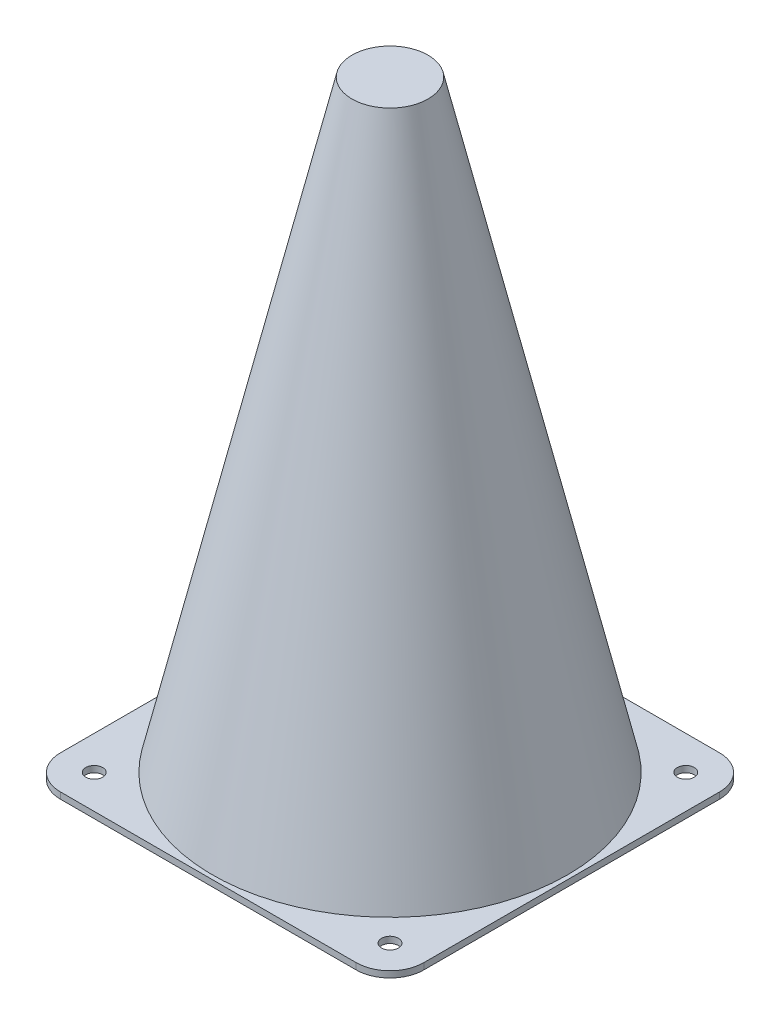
ISO-10303-21;
HEADER;
FILE_DESCRIPTION(('STEP AP214'),'2;1');
FILE_NAME('part.step','',(''),(''),'','','');
FILE_SCHEMA(('AUTOMOTIVE_DESIGN { 1 0 10303 214 1 1 1 1 }'));
ENDSEC;
DATA;
#1=APPLICATION_CONTEXT('core data for automotive mechanical design processes');
#2=APPLICATION_PROTOCOL_DEFINITION('international standard','automotive_design',2000,#1);
#3=PRODUCT_CONTEXT('',#1,'mechanical');
#4=PRODUCT('Part','Part','',(#3));
#5=PRODUCT_RELATED_PRODUCT_CATEGORY('part','',(#4));
#6=PRODUCT_DEFINITION_FORMATION('','',#4);
#7=PRODUCT_DEFINITION_CONTEXT('part definition',#1,'design');
#8=PRODUCT_DEFINITION('design','',#6,#7);
#9=PRODUCT_DEFINITION_SHAPE('','',#8);
#10=(LENGTH_UNIT() NAMED_UNIT(*) SI_UNIT(.MILLI.,.METRE.));
#11=(NAMED_UNIT(*) PLANE_ANGLE_UNIT() SI_UNIT($,.RADIAN.));
#12=(NAMED_UNIT(*) SI_UNIT($,.STERADIAN.) SOLID_ANGLE_UNIT());
#13=UNCERTAINTY_MEASURE_WITH_UNIT(LENGTH_MEASURE(1.E-05),#10,'distance_accuracy_value','');
#14=(GEOMETRIC_REPRESENTATION_CONTEXT(3) GLOBAL_UNCERTAINTY_ASSIGNED_CONTEXT((#13)) GLOBAL_UNIT_ASSIGNED_CONTEXT((#10,
#11,#12)) REPRESENTATION_CONTEXT('',''));
#15=CARTESIAN_POINT('',(0.,0.,0.));
#16=DIRECTION('',(0.,0.,1.));
#17=DIRECTION('',(1.,0.,0.));
#18=AXIS2_PLACEMENT_3D('',#15,#16,#17);
#19=CARTESIAN_POINT('',(55.5625,2.38125,-55.5625));
#20=DIRECTION('',(0.,1.,0.));
#21=DIRECTION('',(0.,0.,1.));
#22=AXIS2_PLACEMENT_3D('',#19,#20,#21);
#23=PLANE('',#22);
#24=CARTESIAN_POINT('',(55.5625,2.38125,55.5625));
#25=DIRECTION('',(0.,1.,0.));
#26=DIRECTION('',(0.,0.,1.));
#27=AXIS2_PLACEMENT_3D('',#24,#25,#26);
#28=CIRCLE('',#27,3.175);
#29=CARTESIAN_POINT('',(55.5625,2.38125,52.3875));
#30=VERTEX_POINT('',#29);
#31=EDGE_CURVE('E195',#30,#30,#28,.T.);
#32=ORIENTED_EDGE('',*,*,#31,.F.);
#33=EDGE_LOOP('',(#32));
#34=FACE_BOUND('',#33,.T.);
#35=CARTESIAN_POINT('',(-55.5625,2.38125,-55.5625));
#36=DIRECTION('',(0.,1.,0.));
#37=DIRECTION('',(0.,0.,1.));
#38=AXIS2_PLACEMENT_3D('',#35,#36,#37);
#39=CIRCLE('',#38,3.175);
#40=CARTESIAN_POINT('',(-55.5625,2.38125,-58.7375));
#41=VERTEX_POINT('',#40);
#42=EDGE_CURVE('E183',#41,#41,#39,.T.);
#43=ORIENTED_EDGE('',*,*,#42,.F.);
#44=EDGE_LOOP('',(#43));
#45=FACE_BOUND('',#44,.T.);
#46=CARTESIAN_POINT('',(55.5625,2.38125,-55.5625));
#47=DIRECTION('',(0.,1.,0.));
#48=DIRECTION('',(0.,0.,1.));
#49=AXIS2_PLACEMENT_3D('',#46,#47,#48);
#50=CIRCLE('',#49,12.7);
#51=CARTESIAN_POINT('',(68.2624999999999,2.38125,-55.5625));
#52=VERTEX_POINT('',#51);
#53=CARTESIAN_POINT('',(55.5625,2.38125,-68.2625));
#54=VERTEX_POINT('',#53);
#55=EDGE_CURVE('E143',#52,#54,#50,.T.);
#56=ORIENTED_EDGE('',*,*,#55,.T.);
#57=DIRECTION('',(-1.,0.,0.));
#58=VECTOR('',#57,1.);
#59=CARTESIAN_POINT('',(-55.5625,2.38125,-68.2625));
#60=LINE('',#59,#58);
#61=CARTESIAN_POINT('',(-55.5625,2.38125,-68.2625));
#62=VERTEX_POINT('',#61);
#63=EDGE_CURVE('E91',#54,#62,#60,.T.);
#64=ORIENTED_EDGE('',*,*,#63,.T.);
#65=CARTESIAN_POINT('',(-55.5625,2.38125,-55.5625));
#66=DIRECTION('',(0.,1.,0.));
#67=DIRECTION('',(0.,0.,1.));
#68=AXIS2_PLACEMENT_3D('',#65,#66,#67);
#69=CIRCLE('',#68,12.7);
#70=CARTESIAN_POINT('',(-68.2625,2.38125,-55.5625));
#71=VERTEX_POINT('',#70);
#72=EDGE_CURVE('E158',#62,#71,#69,.T.);
#73=ORIENTED_EDGE('',*,*,#72,.T.);
#74=DIRECTION('',(0.,0.,1.));
#75=VECTOR('',#74,1.);
#76=CARTESIAN_POINT('',(-68.2625,2.38125,-55.5625));
#77=LINE('',#76,#75);
#78=CARTESIAN_POINT('',(-68.2625,2.38125,55.5625));
#79=VERTEX_POINT('',#78);
#80=EDGE_CURVE('E171',#71,#79,#77,.T.);
#81=ORIENTED_EDGE('',*,*,#80,.T.);
#82=CARTESIAN_POINT('',(-55.5625,2.38125,55.5625));
#83=DIRECTION('',(0.,1.,0.));
#84=DIRECTION('',(0.,0.,-1.));
#85=AXIS2_PLACEMENT_3D('',#82,#83,#84);
#86=CIRCLE('',#85,12.7);
#87=CARTESIAN_POINT('',(-55.5625,2.38125,68.2625));
#88=VERTEX_POINT('',#87);
#89=EDGE_CURVE('E110',#79,#88,#86,.T.);
#90=ORIENTED_EDGE('',*,*,#89,.T.);
#91=DIRECTION('',(1.,0.,0.));
#92=VECTOR('',#91,1.);
#93=CARTESIAN_POINT('',(-55.5625,2.38125,68.2625));
#94=LINE('',#93,#92);
#95=CARTESIAN_POINT('',(55.5625,2.38125,68.2625));
#96=VERTEX_POINT('',#95);
#97=EDGE_CURVE('E104',#88,#96,#94,.T.);
#98=ORIENTED_EDGE('',*,*,#97,.T.);
#99=CARTESIAN_POINT('',(55.5625,2.38125,55.5625));
#100=DIRECTION('',(0.,1.,0.));
#101=DIRECTION('',(0.,0.,-1.));
#102=AXIS2_PLACEMENT_3D('',#99,#100,#101);
#103=CIRCLE('',#102,12.7);
#104=CARTESIAN_POINT('',(68.2624999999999,2.38125,55.5625));
#105=VERTEX_POINT('',#104);
#106=EDGE_CURVE('E108',#96,#105,#103,.T.);
#107=ORIENTED_EDGE('',*,*,#106,.T.);
#108=DIRECTION('',(0.,0.,-1.));
#109=VECTOR('',#108,1.);
#110=CARTESIAN_POINT('',(68.2624999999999,2.38125,-55.5625));
#111=LINE('',#110,#109);
#112=EDGE_CURVE('E48',#105,#52,#111,.T.);
#113=ORIENTED_EDGE('',*,*,#112,.T.);
#114=EDGE_LOOP('',(#56,#64,#73,#81,#90,#98,#107,#113));
#115=FACE_BOUND('',#114,.T.);
#116=CARTESIAN_POINT('',(55.5625,2.38125,-55.5625));
#117=DIRECTION('',(0.,1.,0.));
#118=DIRECTION('',(0.,0.,1.));
#119=AXIS2_PLACEMENT_3D('',#116,#117,#118);
#120=CIRCLE('',#119,3.175);
#121=CARTESIAN_POINT('',(55.5625,2.38125,-58.7375));
#122=VERTEX_POINT('',#121);
#123=EDGE_CURVE('E179',#122,#122,#120,.T.);
#124=ORIENTED_EDGE('',*,*,#123,.F.);
#125=EDGE_LOOP('',(#124));
#126=FACE_BOUND('',#125,.T.);
#127=CARTESIAN_POINT('',(-55.5625,2.38125,55.5625));
#128=DIRECTION('',(0.,1.,0.));
#129=DIRECTION('',(0.,0.,1.));
#130=AXIS2_PLACEMENT_3D('',#127,#128,#129);
#131=CIRCLE('',#130,3.175);
#132=CARTESIAN_POINT('',(-55.5625,2.38125,52.3875));
#133=VERTEX_POINT('',#132);
#134=EDGE_CURVE('E189',#133,#133,#131,.T.);
#135=ORIENTED_EDGE('',*,*,#134,.F.);
#136=EDGE_LOOP('',(#135));
#137=FACE_BOUND('',#136,.T.);
#138=CARTESIAN_POINT('',(0.,2.38125,0.));
#139=DIRECTION('',(0.,1.,0.));
#140=DIRECTION('',(-1.,0.,0.));
#141=AXIS2_PLACEMENT_3D('',#138,#139,#140);
#142=CIRCLE('',#141,66.7170786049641);
#143=CARTESIAN_POINT('',(66.7170786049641,2.38125,0.));
#144=VERTEX_POINT('',#143);
#145=EDGE_CURVE('E212',#144,#144,#142,.T.);
#146=ORIENTED_EDGE('',*,*,#145,.F.);
#147=EDGE_LOOP('',(#146));
#148=FACE_BOUND('',#147,.T.);
#149=ADVANCED_FACE('F31',(#34,#45,#115,#126,#137,#148),#23,.T.);
#150=CARTESIAN_POINT('',(55.5625,0.,-55.5625));
#151=DIRECTION('',(0.,1.,0.));
#152=DIRECTION('',(0.,0.,1.));
#153=AXIS2_PLACEMENT_3D('',#150,#151,#152);
#154=PLANE('',#153);
#155=CARTESIAN_POINT('',(-55.5625,0.,55.5625));
#156=DIRECTION('',(0.,1.,0.));
#157=DIRECTION('',(0.,0.,1.));
#158=AXIS2_PLACEMENT_3D('',#155,#156,#157);
#159=CIRCLE('',#158,3.175);
#160=CARTESIAN_POINT('',(-55.5625,0.,52.3875));
#161=VERTEX_POINT('',#160);
#162=EDGE_CURVE('E192',#161,#161,#159,.T.);
#163=ORIENTED_EDGE('',*,*,#162,.T.);
#164=EDGE_LOOP('',(#163));
#165=FACE_BOUND('',#164,.T.);
#166=CARTESIAN_POINT('',(55.5625,0.,-55.5625));
#167=DIRECTION('',(0.,1.,0.));
#168=DIRECTION('',(0.,0.,1.));
#169=AXIS2_PLACEMENT_3D('',#166,#167,#168);
#170=CIRCLE('',#169,3.175);
#171=CARTESIAN_POINT('',(55.5625,0.,-58.7375));
#172=VERTEX_POINT('',#171);
#173=EDGE_CURVE('E180',#172,#172,#170,.T.);
#174=ORIENTED_EDGE('',*,*,#173,.T.);
#175=EDGE_LOOP('',(#174));
#176=FACE_BOUND('',#175,.T.);
#177=CARTESIAN_POINT('',(55.5625,0.,-55.5625));
#178=DIRECTION('',(0.,1.,0.));
#179=DIRECTION('',(0.,0.,1.));
#180=AXIS2_PLACEMENT_3D('',#177,#178,#179);
#181=CIRCLE('',#180,12.7);
#182=CARTESIAN_POINT('',(68.2624999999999,0.,-55.5625));
#183=VERTEX_POINT('',#182);
#184=CARTESIAN_POINT('',(55.5625,0.,-68.2625));
#185=VERTEX_POINT('',#184);
#186=EDGE_CURVE('E128',#183,#185,#181,.T.);
#187=ORIENTED_EDGE('',*,*,#186,.F.);
#188=DIRECTION('',(0.,0.,-1.));
#189=VECTOR('',#188,1.);
#190=CARTESIAN_POINT('',(68.2624999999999,0.,-55.5625));
#191=LINE('',#190,#189);
#192=CARTESIAN_POINT('',(68.2624999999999,0.,55.5625));
#193=VERTEX_POINT('',#192);
#194=EDGE_CURVE('E83',#193,#183,#191,.T.);
#195=ORIENTED_EDGE('',*,*,#194,.F.);
#196=CARTESIAN_POINT('',(55.5625,0.,55.5625));
#197=DIRECTION('',(0.,1.,0.));
#198=DIRECTION('',(0.,0.,-1.));
#199=AXIS2_PLACEMENT_3D('',#196,#197,#198);
#200=CIRCLE('',#199,12.7);
#201=CARTESIAN_POINT('',(55.5625,0.,68.2625));
#202=VERTEX_POINT('',#201);
#203=EDGE_CURVE('E77',#202,#193,#200,.T.);
#204=ORIENTED_EDGE('',*,*,#203,.F.);
#205=DIRECTION('',(1.,0.,0.));
#206=VECTOR('',#205,1.);
#207=CARTESIAN_POINT('',(-55.5625,0.,68.2625));
#208=LINE('',#207,#206);
#209=CARTESIAN_POINT('',(-55.5625,0.,68.2625));
#210=VERTEX_POINT('',#209);
#211=EDGE_CURVE('E118',#210,#202,#208,.T.);
#212=ORIENTED_EDGE('',*,*,#211,.F.);
#213=CARTESIAN_POINT('',(-55.5625,0.,55.5625));
#214=DIRECTION('',(0.,1.,0.));
#215=DIRECTION('',(0.,0.,-1.));
#216=AXIS2_PLACEMENT_3D('',#213,#214,#215);
#217=CIRCLE('',#216,12.7);
#218=CARTESIAN_POINT('',(-68.2625,0.,55.5625));
#219=VERTEX_POINT('',#218);
#220=EDGE_CURVE('E138',#219,#210,#217,.T.);
#221=ORIENTED_EDGE('',*,*,#220,.F.);
#222=DIRECTION('',(0.,0.,1.));
#223=VECTOR('',#222,1.);
#224=CARTESIAN_POINT('',(-68.2625,0.,-55.5625));
#225=LINE('',#224,#223);
#226=CARTESIAN_POINT('',(-68.2625,0.,-55.5625));
#227=VERTEX_POINT('',#226);
#228=EDGE_CURVE('E136',#227,#219,#225,.T.);
#229=ORIENTED_EDGE('',*,*,#228,.F.);
#230=CARTESIAN_POINT('',(-55.5625,0.,-55.5625));
#231=DIRECTION('',(0.,1.,0.));
#232=DIRECTION('',(0.,0.,1.));
#233=AXIS2_PLACEMENT_3D('',#230,#231,#232);
#234=CIRCLE('',#233,12.7);
#235=CARTESIAN_POINT('',(-55.5625,0.,-68.2625));
#236=VERTEX_POINT('',#235);
#237=EDGE_CURVE('E134',#236,#227,#234,.T.);
#238=ORIENTED_EDGE('',*,*,#237,.F.);
#239=DIRECTION('',(-1.,0.,0.));
#240=VECTOR('',#239,1.);
#241=CARTESIAN_POINT('',(-55.5625,0.,-68.2625));
#242=LINE('',#241,#240);
#243=EDGE_CURVE('E131',#185,#236,#242,.T.);
#244=ORIENTED_EDGE('',*,*,#243,.F.);
#245=EDGE_LOOP('',(#187,#195,#204,#212,#221,#229,#238,#244));
#246=FACE_BOUND('',#245,.T.);
#247=CARTESIAN_POINT('',(0.,0.,0.));
#248=DIRECTION('',(0.,1.,0.));
#249=DIRECTION('',(0.,0.,1.));
#250=AXIS2_PLACEMENT_3D('',#247,#248,#249);
#251=CIRCLE('',#250,65.0875);
#252=CARTESIAN_POINT('',(0.,0.,-65.0875));
#253=VERTEX_POINT('',#252);
#254=EDGE_CURVE('E132',#253,#253,#251,.T.);
#255=ORIENTED_EDGE('',*,*,#254,.T.);
#256=EDGE_LOOP('',(#255));
#257=FACE_BOUND('',#256,.T.);
#258=CARTESIAN_POINT('',(-55.5625,0.,-55.5625));
#259=DIRECTION('',(0.,1.,0.));
#260=DIRECTION('',(0.,0.,1.));
#261=AXIS2_PLACEMENT_3D('',#258,#259,#260);
#262=CIRCLE('',#261,3.175);
#263=CARTESIAN_POINT('',(-55.5625,0.,-58.7375));
#264=VERTEX_POINT('',#263);
#265=EDGE_CURVE('E186',#264,#264,#262,.T.);
#266=ORIENTED_EDGE('',*,*,#265,.T.);
#267=EDGE_LOOP('',(#266));
#268=FACE_BOUND('',#267,.T.);
#269=CARTESIAN_POINT('',(55.5625,0.,55.5625));
#270=DIRECTION('',(0.,1.,0.));
#271=DIRECTION('',(0.,0.,1.));
#272=AXIS2_PLACEMENT_3D('',#269,#270,#271);
#273=CIRCLE('',#272,3.175);
#274=CARTESIAN_POINT('',(55.5625,0.,52.3875));
#275=VERTEX_POINT('',#274);
#276=EDGE_CURVE('E198',#275,#275,#273,.T.);
#277=ORIENTED_EDGE('',*,*,#276,.T.);
#278=EDGE_LOOP('',(#277));
#279=FACE_BOUND('',#278,.T.);
#280=ADVANCED_FACE('F162',(#165,#176,#246,#257,#268,#279),#154,.F.);
#281=CARTESIAN_POINT('',(55.5625,2.38125,-55.5625));
#282=DIRECTION('',(0.,-1.,0.));
#283=DIRECTION('',(0.,0.,-1.));
#284=AXIS2_PLACEMENT_3D('',#281,#282,#283);
#285=CYLINDRICAL_SURFACE('',#284,12.7);
#286=ORIENTED_EDGE('',*,*,#186,.T.);
#287=DIRECTION('',(0.,-1.,0.));
#288=VECTOR('',#287,1.);
#289=CARTESIAN_POINT('',(55.5625,2.38125,-68.2625));
#290=LINE('',#289,#288);
#291=EDGE_CURVE('E11',#54,#185,#290,.T.);
#292=ORIENTED_EDGE('',*,*,#291,.F.);
#293=ORIENTED_EDGE('',*,*,#55,.F.);
#294=DIRECTION('',(0.,-1.,0.));
#295=VECTOR('',#294,1.);
#296=CARTESIAN_POINT('',(68.2624999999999,2.38125,-55.5625));
#297=LINE('',#296,#295);
#298=EDGE_CURVE('E124',#52,#183,#297,.T.);
#299=ORIENTED_EDGE('',*,*,#298,.T.);
#300=EDGE_LOOP('',(#286,#292,#293,#299));
#301=FACE_BOUND('',#300,.T.);
#302=ADVANCED_FACE('F33',(#301),#285,.T.);
#303=CARTESIAN_POINT('',(-55.5625,2.38125,-68.2625));
#304=DIRECTION('',(0.,0.,1.));
#305=DIRECTION('',(1.,0.,0.));
#306=AXIS2_PLACEMENT_3D('',#303,#304,#305);
#307=PLANE('',#306);
#308=ORIENTED_EDGE('',*,*,#243,.T.);
#309=DIRECTION('',(0.,-1.,0.));
#310=VECTOR('',#309,1.);
#311=CARTESIAN_POINT('',(-55.5625,2.38125,-68.2625));
#312=LINE('',#311,#310);
#313=EDGE_CURVE('E40',#62,#236,#312,.T.);
#314=ORIENTED_EDGE('',*,*,#313,.F.);
#315=ORIENTED_EDGE('',*,*,#63,.F.);
#316=ORIENTED_EDGE('',*,*,#291,.T.);
#317=EDGE_LOOP('',(#308,#314,#315,#316));
#318=FACE_BOUND('',#317,.T.);
#319=ADVANCED_FACE('F244',(#318),#307,.F.);
#320=CARTESIAN_POINT('',(-55.5625,2.38125,-55.5625));
#321=DIRECTION('',(0.,-1.,0.));
#322=DIRECTION('',(0.,0.,-1.));
#323=AXIS2_PLACEMENT_3D('',#320,#321,#322);
#324=CYLINDRICAL_SURFACE('',#323,12.7);
#325=ORIENTED_EDGE('',*,*,#237,.T.);
#326=DIRECTION('',(0.,-1.,0.));
#327=VECTOR('',#326,1.);
#328=CARTESIAN_POINT('',(-68.2625,2.38125,-55.5625));
#329=LINE('',#328,#327);
#330=EDGE_CURVE('E150',#71,#227,#329,.T.);
#331=ORIENTED_EDGE('',*,*,#330,.F.);
#332=ORIENTED_EDGE('',*,*,#72,.F.);
#333=ORIENTED_EDGE('',*,*,#313,.T.);
#334=EDGE_LOOP('',(#325,#331,#332,#333));
#335=FACE_BOUND('',#334,.T.);
#336=ADVANCED_FACE('F156',(#335),#324,.T.);
#337=CARTESIAN_POINT('',(-68.2625,2.38125,-55.5625));
#338=DIRECTION('',(1.,0.,0.));
#339=DIRECTION('',(0.,0.,-1.));
#340=AXIS2_PLACEMENT_3D('',#337,#338,#339);
#341=PLANE('',#340);
#342=ORIENTED_EDGE('',*,*,#228,.T.);
#343=DIRECTION('',(0.,-1.,0.));
#344=VECTOR('',#343,1.);
#345=CARTESIAN_POINT('',(-68.2625,2.38125,55.5625));
#346=LINE('',#345,#344);
#347=EDGE_CURVE('E147',#79,#219,#346,.T.);
#348=ORIENTED_EDGE('',*,*,#347,.F.);
#349=ORIENTED_EDGE('',*,*,#80,.F.);
#350=ORIENTED_EDGE('',*,*,#330,.T.);
#351=EDGE_LOOP('',(#342,#348,#349,#350));
#352=FACE_BOUND('',#351,.T.);
#353=ADVANCED_FACE('F167',(#352),#341,.F.);
#354=CARTESIAN_POINT('',(-55.5625,2.38125,55.5625));
#355=DIRECTION('',(0.,-1.,0.));
#356=DIRECTION('',(0.,0.,-1.));
#357=AXIS2_PLACEMENT_3D('',#354,#355,#356);
#358=CYLINDRICAL_SURFACE('',#357,12.7);
#359=ORIENTED_EDGE('',*,*,#220,.T.);
#360=DIRECTION('',(0.,-1.,0.));
#361=VECTOR('',#360,1.);
#362=CARTESIAN_POINT('',(-55.5625,2.38125,68.2625));
#363=LINE('',#362,#361);
#364=EDGE_CURVE('E119',#88,#210,#363,.T.);
#365=ORIENTED_EDGE('',*,*,#364,.F.);
#366=ORIENTED_EDGE('',*,*,#89,.F.);
#367=ORIENTED_EDGE('',*,*,#347,.T.);
#368=EDGE_LOOP('',(#359,#365,#366,#367));
#369=FACE_BOUND('',#368,.T.);
#370=ADVANCED_FACE('F170',(#369),#358,.T.);
#371=CARTESIAN_POINT('',(-55.5625,2.38125,68.2625));
#372=DIRECTION('',(0.,0.,-1.));
#373=DIRECTION('',(-1.,0.,0.));
#374=AXIS2_PLACEMENT_3D('',#371,#372,#373);
#375=PLANE('',#374);
#376=ORIENTED_EDGE('',*,*,#211,.T.);
#377=DIRECTION('',(0.,-1.,0.));
#378=VECTOR('',#377,1.);
#379=CARTESIAN_POINT('',(55.5625,2.38125,68.2625));
#380=LINE('',#379,#378);
#381=EDGE_CURVE('E115',#96,#202,#380,.T.);
#382=ORIENTED_EDGE('',*,*,#381,.F.);
#383=ORIENTED_EDGE('',*,*,#97,.F.);
#384=ORIENTED_EDGE('',*,*,#364,.T.);
#385=EDGE_LOOP('',(#376,#382,#383,#384));
#386=FACE_BOUND('',#385,.T.);
#387=ADVANCED_FACE('F116',(#386),#375,.F.);
#388=CARTESIAN_POINT('',(55.5625,2.38125,55.5625));
#389=DIRECTION('',(0.,-1.,0.));
#390=DIRECTION('',(0.,0.,-1.));
#391=AXIS2_PLACEMENT_3D('',#388,#389,#390);
#392=CYLINDRICAL_SURFACE('',#391,12.7);
#393=ORIENTED_EDGE('',*,*,#203,.T.);
#394=DIRECTION('',(0.,-1.,0.));
#395=VECTOR('',#394,1.);
#396=CARTESIAN_POINT('',(68.2624999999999,2.38125,55.5625));
#397=LINE('',#396,#395);
#398=EDGE_CURVE('E120',#105,#193,#397,.T.);
#399=ORIENTED_EDGE('',*,*,#398,.F.);
#400=ORIENTED_EDGE('',*,*,#106,.F.);
#401=ORIENTED_EDGE('',*,*,#381,.T.);
#402=EDGE_LOOP('',(#393,#399,#400,#401));
#403=FACE_BOUND('',#402,.T.);
#404=ADVANCED_FACE('F122',(#403),#392,.T.);
#405=CARTESIAN_POINT('',(68.2624999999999,2.38125,-55.5625));
#406=DIRECTION('',(-1.,0.,0.));
#407=DIRECTION('',(0.,0.,1.));
#408=AXIS2_PLACEMENT_3D('',#405,#406,#407);
#409=PLANE('',#408);
#410=ORIENTED_EDGE('',*,*,#194,.T.);
#411=ORIENTED_EDGE('',*,*,#298,.F.);
#412=ORIENTED_EDGE('',*,*,#112,.F.);
#413=ORIENTED_EDGE('',*,*,#398,.T.);
#414=EDGE_LOOP('',(#410,#411,#412,#413));
#415=FACE_BOUND('',#414,.T.);
#416=ADVANCED_FACE('F232',(#415),#409,.F.);
#417=CARTESIAN_POINT('',(0.,2.38125,0.));
#418=DIRECTION('',(0.,-1.,0.));
#419=DIRECTION('',(0.,0.,-1.));
#420=AXIS2_PLACEMENT_3D('',#417,#418,#419);
#421=CYLINDRICAL_SURFACE('',#420,65.0875);
#422=CARTESIAN_POINT('',(0.,2.38125,0.));
#423=DIRECTION('',(0.,1.,0.));
#424=DIRECTION('',(-1.,0.,0.));
#425=AXIS2_PLACEMENT_3D('',#422,#423,#424);
#426=CIRCLE('',#425,65.0874999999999);
#427=CARTESIAN_POINT('',(0.,2.38125,-65.0875));
#428=VERTEX_POINT('',#427);
#429=EDGE_CURVE('E201',#428,#428,#426,.T.);
#430=CARTESIAN_POINT('',(0.,2.38125,-65.0875));
#431=CARTESIAN_POINT('',(0.,2.3564453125,-65.0875));
#432=CARTESIAN_POINT('',(0.,2.331640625,-65.0875));
#433=CARTESIAN_POINT('',(0.,2.28203125,-65.0875));
#434=CARTESIAN_POINT('',(0.,2.2572265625,-65.0875));
#435=CARTESIAN_POINT('',(0.,2.2076171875,-65.0875));
#436=CARTESIAN_POINT('',(0.,2.1828125,-65.0875));
#437=CARTESIAN_POINT('',(0.,2.133203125,-65.0875));
#438=CARTESIAN_POINT('',(0.,2.1083984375,-65.0875));
#439=CARTESIAN_POINT('',(0.,2.0587890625,-65.0875));
#440=CARTESIAN_POINT('',(0.,2.033984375,-65.0875));
#441=CARTESIAN_POINT('',(0.,1.984375,-65.0875));
#442=CARTESIAN_POINT('',(0.,1.9595703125,-65.0875));
#443=CARTESIAN_POINT('',(0.,1.9099609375,-65.0875));
#444=CARTESIAN_POINT('',(0.,1.88515625,-65.0875));
#445=CARTESIAN_POINT('',(0.,1.835546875,-65.0875));
#446=CARTESIAN_POINT('',(0.,1.8107421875,-65.0875));
#447=CARTESIAN_POINT('',(0.,1.7611328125,-65.0875));
#448=CARTESIAN_POINT('',(0.,1.736328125,-65.0875));
#449=CARTESIAN_POINT('',(0.,1.68671875,-65.0875));
#450=CARTESIAN_POINT('',(0.,1.6619140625,-65.0875));
#451=CARTESIAN_POINT('',(0.,1.6123046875,-65.0875));
#452=CARTESIAN_POINT('',(0.,1.5875,-65.0875));
#453=CARTESIAN_POINT('',(0.,1.537890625,-65.0875));
#454=CARTESIAN_POINT('',(0.,1.5130859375,-65.0875));
#455=CARTESIAN_POINT('',(0.,1.4634765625,-65.0875));
#456=CARTESIAN_POINT('',(0.,1.438671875,-65.0875));
#457=CARTESIAN_POINT('',(0.,1.3890625,-65.0875));
#458=CARTESIAN_POINT('',(0.,1.3642578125,-65.0875));
#459=CARTESIAN_POINT('',(0.,1.3146484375,-65.0875));
#460=CARTESIAN_POINT('',(0.,1.28984375,-65.0875));
#461=CARTESIAN_POINT('',(0.,1.240234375,-65.0875));
#462=CARTESIAN_POINT('',(0.,1.2154296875,-65.0875));
#463=CARTESIAN_POINT('',(0.,1.1658203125,-65.0875));
#464=CARTESIAN_POINT('',(0.,1.141015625,-65.0875));
#465=CARTESIAN_POINT('',(0.,1.09140625,-65.0875));
#466=CARTESIAN_POINT('',(0.,1.0666015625,-65.0875));
#467=CARTESIAN_POINT('',(0.,1.0169921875,-65.0875));
#468=CARTESIAN_POINT('',(0.,0.992187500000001,-65.0875));
#469=CARTESIAN_POINT('',(0.,0.942578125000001,-65.0875));
#470=CARTESIAN_POINT('',(0.,0.917773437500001,-65.0875));
#471=CARTESIAN_POINT('',(0.,0.8681640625,-65.0875));
#472=CARTESIAN_POINT('',(0.,0.843359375,-65.0875));
#473=CARTESIAN_POINT('',(0.,0.79375,-65.0875));
#474=CARTESIAN_POINT('',(0.,0.7689453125,-65.0875));
#475=CARTESIAN_POINT('',(0.,0.7193359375,-65.0875));
#476=CARTESIAN_POINT('',(0.,0.69453125,-65.0875));
#477=CARTESIAN_POINT('',(0.,0.644921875,-65.0875));
#478=CARTESIAN_POINT('',(0.,0.6201171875,-65.0875));
#479=CARTESIAN_POINT('',(0.,0.5705078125,-65.0875));
#480=CARTESIAN_POINT('',(0.,0.545703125,-65.0875));
#481=CARTESIAN_POINT('',(0.,0.49609375,-65.0875));
#482=CARTESIAN_POINT('',(0.,0.4712890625,-65.0875));
#483=CARTESIAN_POINT('',(0.,0.4216796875,-65.0875));
#484=CARTESIAN_POINT('',(0.,0.396875,-65.0875));
#485=CARTESIAN_POINT('',(0.,0.347265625,-65.0875));
#486=CARTESIAN_POINT('',(0.,0.3224609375,-65.0875));
#487=CARTESIAN_POINT('',(0.,0.2728515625,-65.0875));
#488=CARTESIAN_POINT('',(0.,0.248046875,-65.0875));
#489=CARTESIAN_POINT('',(0.,0.1984375,-65.0875));
#490=CARTESIAN_POINT('',(0.,0.1736328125,-65.0875));
#491=CARTESIAN_POINT('',(0.,0.1240234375,-65.0875));
#492=CARTESIAN_POINT('',(0.,0.0992187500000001,-65.0875));
#493=CARTESIAN_POINT('',(0.,0.049609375,-65.0875));
#494=CARTESIAN_POINT('',(0.,0.0248046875,-65.0875));
#495=CARTESIAN_POINT('',(0.,0.,-65.0875));
#496=B_SPLINE_CURVE_WITH_KNOTS('',3,(#430,#431,#432,#433,#434,#435,#436,#437,#438,#439,#440,
#441,#442,#443,#444,#445,#446,#447,#448,#449,#450,#451,#452,#453,#454,#455,#456,#457,#458,#459,
#460,#461,#462,#463,#464,#465,#466,#467,#468,#469,#470,#471,#472,#473,#474,#475,#476,#477,#478,
#479,#480,#481,#482,#483,#484,#485,#486,#487,#488,#489,#490,#491,#492,#493,#494,#495),
.UNSPECIFIED.,.F.,.F.,(4,2,2,2,2,2,2,2,2,2,2,2,2,2,2,2,2,2,2,2,2,2,2,2,2,2,2,2,2,2,2,2,4),(0.,
0.0744140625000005,0.148828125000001,0.223242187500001,0.297656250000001,0.372070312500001,
0.446484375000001,0.520898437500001,0.595312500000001,0.669726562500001,0.744140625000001,
0.818554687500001,0.892968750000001,0.967382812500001,1.041796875,1.1162109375,1.190625,
1.2650390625,1.339453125,1.4138671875,1.48828125,1.5626953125,1.637109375,1.7115234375,
1.7859375,1.8603515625,1.934765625,2.0091796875,2.08359375,2.1580078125,2.232421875,
2.3068359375,2.38125),.UNSPECIFIED.);
#497=EDGE_CURVE('BSEAM229',#428,#253,#496,.T.);
#498=ORIENTED_EDGE('',*,*,#429,.T.);
#499=ORIENTED_EDGE('',*,*,#254,.F.);
#500=ORIENTED_EDGE('',*,*,#497,.T.);
#501=ORIENTED_EDGE('',*,*,#497,.F.);
#502=EDGE_LOOP('',(#498,#500,#499,#501));
#503=FACE_BOUND('',#502,.T.);
#504=ADVANCED_FACE('F229',(#503),#421,.F.);
#505=CARTESIAN_POINT('',(55.5625,2.38125,-55.5625));
#506=DIRECTION('',(0.,-1.,0.));
#507=DIRECTION('',(0.,0.,-1.));
#508=AXIS2_PLACEMENT_3D('',#505,#506,#507);
#509=CYLINDRICAL_SURFACE('',#508,3.175);
#510=CARTESIAN_POINT('',(55.5625,2.38125,-58.7375));
#511=CARTESIAN_POINT('',(55.5625,2.3564453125,-58.7375));
#512=CARTESIAN_POINT('',(55.5625,2.331640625,-58.7375));
#513=CARTESIAN_POINT('',(55.5625,2.28203125,-58.7375));
#514=CARTESIAN_POINT('',(55.5625,2.2572265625,-58.7375));
#515=CARTESIAN_POINT('',(55.5625,2.2076171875,-58.7375));
#516=CARTESIAN_POINT('',(55.5625,2.1828125,-58.7375));
#517=CARTESIAN_POINT('',(55.5625,2.133203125,-58.7375));
#518=CARTESIAN_POINT('',(55.5625,2.1083984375,-58.7375));
#519=CARTESIAN_POINT('',(55.5625,2.0587890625,-58.7375));
#520=CARTESIAN_POINT('',(55.5625,2.033984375,-58.7375));
#521=CARTESIAN_POINT('',(55.5625,1.984375,-58.7375));
#522=CARTESIAN_POINT('',(55.5625,1.9595703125,-58.7375));
#523=CARTESIAN_POINT('',(55.5625,1.9099609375,-58.7375));
#524=CARTESIAN_POINT('',(55.5625,1.88515625,-58.7375));
#525=CARTESIAN_POINT('',(55.5625,1.835546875,-58.7375));
#526=CARTESIAN_POINT('',(55.5625,1.8107421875,-58.7375));
#527=CARTESIAN_POINT('',(55.5625,1.7611328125,-58.7375));
#528=CARTESIAN_POINT('',(55.5625,1.736328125,-58.7375));
#529=CARTESIAN_POINT('',(55.5625,1.68671875,-58.7375));
#530=CARTESIAN_POINT('',(55.5625,1.6619140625,-58.7375));
#531=CARTESIAN_POINT('',(55.5625,1.6123046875,-58.7375));
#532=CARTESIAN_POINT('',(55.5625,1.5875,-58.7375));
#533=CARTESIAN_POINT('',(55.5625,1.537890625,-58.7375));
#534=CARTESIAN_POINT('',(55.5625,1.5130859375,-58.7375));
#535=CARTESIAN_POINT('',(55.5625,1.4634765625,-58.7375));
#536=CARTESIAN_POINT('',(55.5625,1.438671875,-58.7375));
#537=CARTESIAN_POINT('',(55.5625,1.3890625,-58.7375));
#538=CARTESIAN_POINT('',(55.5625,1.3642578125,-58.7375));
#539=CARTESIAN_POINT('',(55.5625,1.3146484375,-58.7375));
#540=CARTESIAN_POINT('',(55.5625,1.28984375,-58.7375));
#541=CARTESIAN_POINT('',(55.5625,1.240234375,-58.7375));
#542=CARTESIAN_POINT('',(55.5625,1.2154296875,-58.7375));
#543=CARTESIAN_POINT('',(55.5625,1.1658203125,-58.7375));
#544=CARTESIAN_POINT('',(55.5625,1.141015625,-58.7375));
#545=CARTESIAN_POINT('',(55.5625,1.09140625,-58.7375));
#546=CARTESIAN_POINT('',(55.5625,1.0666015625,-58.7375));
#547=CARTESIAN_POINT('',(55.5625,1.0169921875,-58.7375));
#548=CARTESIAN_POINT('',(55.5625,0.9921875,-58.7375));
#549=CARTESIAN_POINT('',(55.5625,0.942578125,-58.7375));
#550=CARTESIAN_POINT('',(55.5625,0.9177734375,-58.7375));
#551=CARTESIAN_POINT('',(55.5625,0.8681640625,-58.7375));
#552=CARTESIAN_POINT('',(55.5625,0.843359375,-58.7375));
#553=CARTESIAN_POINT('',(55.5625,0.79375,-58.7375));
#554=CARTESIAN_POINT('',(55.5625,0.7689453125,-58.7375));
#555=CARTESIAN_POINT('',(55.5625,0.7193359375,-58.7375));
#556=CARTESIAN_POINT('',(55.5625,0.69453125,-58.7375));
#557=CARTESIAN_POINT('',(55.5625,0.644921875,-58.7375));
#558=CARTESIAN_POINT('',(55.5625,0.6201171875,-58.7375));
#559=CARTESIAN_POINT('',(55.5625,0.5705078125,-58.7375));
#560=CARTESIAN_POINT('',(55.5625,0.545703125,-58.7375));
#561=CARTESIAN_POINT('',(55.5625,0.49609375,-58.7375));
#562=CARTESIAN_POINT('',(55.5625,0.4712890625,-58.7375));
#563=CARTESIAN_POINT('',(55.5625,0.4216796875,-58.7375));
#564=CARTESIAN_POINT('',(55.5625,0.396875,-58.7375));
#565=CARTESIAN_POINT('',(55.5625,0.347265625,-58.7375));
#566=CARTESIAN_POINT('',(55.5625,0.3224609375,-58.7375));
#567=CARTESIAN_POINT('',(55.5625,0.2728515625,-58.7375));
#568=CARTESIAN_POINT('',(55.5625,0.248046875,-58.7375));
#569=CARTESIAN_POINT('',(55.5625,0.1984375,-58.7375));
#570=CARTESIAN_POINT('',(55.5625,0.1736328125,-58.7375));
#571=CARTESIAN_POINT('',(55.5625,0.1240234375,-58.7375));
#572=CARTESIAN_POINT('',(55.5625,0.0992187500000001,-58.7375));
#573=CARTESIAN_POINT('',(55.5625,0.049609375,-58.7375));
#574=CARTESIAN_POINT('',(55.5625,0.0248046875,-58.7375));
#575=CARTESIAN_POINT('',(55.5625,0.,-58.7375));
#576=B_SPLINE_CURVE_WITH_KNOTS('',3,(#510,#511,#512,#513,#514,#515,#516,#517,#518,#519,#520,
#521,#522,#523,#524,#525,#526,#527,#528,#529,#530,#531,#532,#533,#534,#535,#536,#537,#538,#539,
#540,#541,#542,#543,#544,#545,#546,#547,#548,#549,#550,#551,#552,#553,#554,#555,#556,#557,#558,
#559,#560,#561,#562,#563,#564,#565,#566,#567,#568,#569,#570,#571,#572,#573,#574,#575),
.UNSPECIFIED.,.F.,.F.,(4,2,2,2,2,2,2,2,2,2,2,2,2,2,2,2,2,2,2,2,2,2,2,2,2,2,2,2,2,2,2,2,4),(0.,
0.0744140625,0.148828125,0.2232421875,0.29765625,0.3720703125,0.446484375,0.5208984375,
0.5953125,0.6697265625,0.744140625,0.8185546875,0.89296875,0.9673828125,1.041796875,
1.1162109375,1.190625,1.2650390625,1.339453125,1.4138671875,1.48828125,1.5626953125,1.637109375,
1.7115234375,1.7859375,1.8603515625,1.934765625,2.0091796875,2.08359375,2.1580078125,
2.232421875,2.3068359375,2.38125),.UNSPECIFIED.);
#577=EDGE_CURVE('BSEAM304',#122,#172,#576,.T.);
#578=ORIENTED_EDGE('',*,*,#123,.T.);
#579=ORIENTED_EDGE('',*,*,#173,.F.);
#580=ORIENTED_EDGE('',*,*,#577,.T.);
#581=ORIENTED_EDGE('',*,*,#577,.F.);
#582=EDGE_LOOP('',(#578,#580,#579,#581));
#583=FACE_BOUND('',#582,.T.);
#584=ADVANCED_FACE('F304',(#583),#509,.F.);
#585=CARTESIAN_POINT('',(-55.5625,2.38125,-55.5625));
#586=DIRECTION('',(0.,-1.,0.));
#587=DIRECTION('',(0.,0.,-1.));
#588=AXIS2_PLACEMENT_3D('',#585,#586,#587);
#589=CYLINDRICAL_SURFACE('',#588,3.175);
#590=CARTESIAN_POINT('',(-55.5625,2.38125,-58.7375));
#591=CARTESIAN_POINT('',(-55.5625,2.3564453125,-58.7375));
#592=CARTESIAN_POINT('',(-55.5625,2.331640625,-58.7375));
#593=CARTESIAN_POINT('',(-55.5625,2.28203125,-58.7375));
#594=CARTESIAN_POINT('',(-55.5625,2.2572265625,-58.7375));
#595=CARTESIAN_POINT('',(-55.5625,2.2076171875,-58.7375));
#596=CARTESIAN_POINT('',(-55.5625,2.1828125,-58.7375));
#597=CARTESIAN_POINT('',(-55.5625,2.133203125,-58.7375));
#598=CARTESIAN_POINT('',(-55.5625,2.1083984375,-58.7375));
#599=CARTESIAN_POINT('',(-55.5625,2.0587890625,-58.7375));
#600=CARTESIAN_POINT('',(-55.5625,2.033984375,-58.7375));
#601=CARTESIAN_POINT('',(-55.5625,1.984375,-58.7375));
#602=CARTESIAN_POINT('',(-55.5625,1.9595703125,-58.7375));
#603=CARTESIAN_POINT('',(-55.5625,1.9099609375,-58.7375));
#604=CARTESIAN_POINT('',(-55.5625,1.88515625,-58.7375));
#605=CARTESIAN_POINT('',(-55.5625,1.835546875,-58.7375));
#606=CARTESIAN_POINT('',(-55.5625,1.8107421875,-58.7375));
#607=CARTESIAN_POINT('',(-55.5625,1.7611328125,-58.7375));
#608=CARTESIAN_POINT('',(-55.5625,1.736328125,-58.7375));
#609=CARTESIAN_POINT('',(-55.5625,1.68671875,-58.7375));
#610=CARTESIAN_POINT('',(-55.5625,1.6619140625,-58.7375));
#611=CARTESIAN_POINT('',(-55.5625,1.6123046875,-58.7375));
#612=CARTESIAN_POINT('',(-55.5625,1.5875,-58.7375));
#613=CARTESIAN_POINT('',(-55.5625,1.537890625,-58.7375));
#614=CARTESIAN_POINT('',(-55.5625,1.5130859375,-58.7375));
#615=CARTESIAN_POINT('',(-55.5625,1.4634765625,-58.7375));
#616=CARTESIAN_POINT('',(-55.5625,1.438671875,-58.7375));
#617=CARTESIAN_POINT('',(-55.5625,1.3890625,-58.7375));
#618=CARTESIAN_POINT('',(-55.5625,1.3642578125,-58.7375));
#619=CARTESIAN_POINT('',(-55.5625,1.3146484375,-58.7375));
#620=CARTESIAN_POINT('',(-55.5625,1.28984375,-58.7375));
#621=CARTESIAN_POINT('',(-55.5625,1.240234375,-58.7375));
#622=CARTESIAN_POINT('',(-55.5625,1.2154296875,-58.7375));
#623=CARTESIAN_POINT('',(-55.5625,1.1658203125,-58.7375));
#624=CARTESIAN_POINT('',(-55.5625,1.141015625,-58.7375));
#625=CARTESIAN_POINT('',(-55.5625,1.09140625,-58.7375));
#626=CARTESIAN_POINT('',(-55.5625,1.0666015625,-58.7375));
#627=CARTESIAN_POINT('',(-55.5625,1.0169921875,-58.7375));
#628=CARTESIAN_POINT('',(-55.5625,0.9921875,-58.7375));
#629=CARTESIAN_POINT('',(-55.5625,0.942578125,-58.7375));
#630=CARTESIAN_POINT('',(-55.5625,0.9177734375,-58.7375));
#631=CARTESIAN_POINT('',(-55.5625,0.8681640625,-58.7375));
#632=CARTESIAN_POINT('',(-55.5625,0.843359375,-58.7375));
#633=CARTESIAN_POINT('',(-55.5625,0.79375,-58.7375));
#634=CARTESIAN_POINT('',(-55.5625,0.7689453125,-58.7375));
#635=CARTESIAN_POINT('',(-55.5625,0.7193359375,-58.7375));
#636=CARTESIAN_POINT('',(-55.5625,0.69453125,-58.7375));
#637=CARTESIAN_POINT('',(-55.5625,0.644921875,-58.7375));
#638=CARTESIAN_POINT('',(-55.5625,0.6201171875,-58.7375));
#639=CARTESIAN_POINT('',(-55.5625,0.5705078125,-58.7375));
#640=CARTESIAN_POINT('',(-55.5625,0.545703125,-58.7375));
#641=CARTESIAN_POINT('',(-55.5625,0.49609375,-58.7375));
#642=CARTESIAN_POINT('',(-55.5625,0.4712890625,-58.7375));
#643=CARTESIAN_POINT('',(-55.5625,0.4216796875,-58.7375));
#644=CARTESIAN_POINT('',(-55.5625,0.396875,-58.7375));
#645=CARTESIAN_POINT('',(-55.5625,0.347265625,-58.7375));
#646=CARTESIAN_POINT('',(-55.5625,0.3224609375,-58.7375));
#647=CARTESIAN_POINT('',(-55.5625,0.2728515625,-58.7375));
#648=CARTESIAN_POINT('',(-55.5625,0.248046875,-58.7375));
#649=CARTESIAN_POINT('',(-55.5625,0.1984375,-58.7375));
#650=CARTESIAN_POINT('',(-55.5625,0.1736328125,-58.7375));
#651=CARTESIAN_POINT('',(-55.5625,0.1240234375,-58.7375));
#652=CARTESIAN_POINT('',(-55.5625,0.0992187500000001,-58.7375));
#653=CARTESIAN_POINT('',(-55.5625,0.049609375,-58.7375));
#654=CARTESIAN_POINT('',(-55.5625,0.0248046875,-58.7375));
#655=CARTESIAN_POINT('',(-55.5625,0.,-58.7375));
#656=B_SPLINE_CURVE_WITH_KNOTS('',3,(#590,#591,#592,#593,#594,#595,#596,#597,#598,#599,#600,
#601,#602,#603,#604,#605,#606,#607,#608,#609,#610,#611,#612,#613,#614,#615,#616,#617,#618,#619,
#620,#621,#622,#623,#624,#625,#626,#627,#628,#629,#630,#631,#632,#633,#634,#635,#636,#637,#638,
#639,#640,#641,#642,#643,#644,#645,#646,#647,#648,#649,#650,#651,#652,#653,#654,#655),
.UNSPECIFIED.,.F.,.F.,(4,2,2,2,2,2,2,2,2,2,2,2,2,2,2,2,2,2,2,2,2,2,2,2,2,2,2,2,2,2,2,2,4),(0.,
0.0744140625,0.148828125,0.2232421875,0.29765625,0.3720703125,0.446484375,0.5208984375,
0.5953125,0.6697265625,0.744140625,0.8185546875,0.89296875,0.9673828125,1.041796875,
1.1162109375,1.190625,1.2650390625,1.339453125,1.4138671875,1.48828125,1.5626953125,1.637109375,
1.7115234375,1.7859375,1.8603515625,1.934765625,2.0091796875,2.08359375,2.1580078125,
2.232421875,2.3068359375,2.38125),.UNSPECIFIED.);
#657=EDGE_CURVE('BSEAM312',#41,#264,#656,.T.);
#658=ORIENTED_EDGE('',*,*,#42,.T.);
#659=ORIENTED_EDGE('',*,*,#265,.F.);
#660=ORIENTED_EDGE('',*,*,#657,.T.);
#661=ORIENTED_EDGE('',*,*,#657,.F.);
#662=EDGE_LOOP('',(#658,#660,#659,#661));
#663=FACE_BOUND('',#662,.T.);
#664=ADVANCED_FACE('F312',(#663),#589,.F.);
#665=CARTESIAN_POINT('',(-55.5625,2.38125,55.5625));
#666=DIRECTION('',(0.,-1.,0.));
#667=DIRECTION('',(0.,0.,-1.));
#668=AXIS2_PLACEMENT_3D('',#665,#666,#667);
#669=CYLINDRICAL_SURFACE('',#668,3.175);
#670=CARTESIAN_POINT('',(-55.5625,2.38125,52.3875));
#671=CARTESIAN_POINT('',(-55.5625,2.3564453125,52.3875));
#672=CARTESIAN_POINT('',(-55.5625,2.331640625,52.3875));
#673=CARTESIAN_POINT('',(-55.5625,2.28203125,52.3875));
#674=CARTESIAN_POINT('',(-55.5625,2.2572265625,52.3875));
#675=CARTESIAN_POINT('',(-55.5625,2.2076171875,52.3875));
#676=CARTESIAN_POINT('',(-55.5625,2.1828125,52.3875));
#677=CARTESIAN_POINT('',(-55.5625,2.133203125,52.3875));
#678=CARTESIAN_POINT('',(-55.5625,2.1083984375,52.3875));
#679=CARTESIAN_POINT('',(-55.5625,2.0587890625,52.3875));
#680=CARTESIAN_POINT('',(-55.5625,2.033984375,52.3875));
#681=CARTESIAN_POINT('',(-55.5625,1.984375,52.3875));
#682=CARTESIAN_POINT('',(-55.5625,1.9595703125,52.3875));
#683=CARTESIAN_POINT('',(-55.5625,1.9099609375,52.3875));
#684=CARTESIAN_POINT('',(-55.5625,1.88515625,52.3875));
#685=CARTESIAN_POINT('',(-55.5625,1.835546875,52.3875));
#686=CARTESIAN_POINT('',(-55.5625,1.8107421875,52.3875));
#687=CARTESIAN_POINT('',(-55.5625,1.7611328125,52.3875));
#688=CARTESIAN_POINT('',(-55.5625,1.736328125,52.3875));
#689=CARTESIAN_POINT('',(-55.5625,1.68671875,52.3875));
#690=CARTESIAN_POINT('',(-55.5625,1.6619140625,52.3875));
#691=CARTESIAN_POINT('',(-55.5625,1.6123046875,52.3875));
#692=CARTESIAN_POINT('',(-55.5625,1.5875,52.3875));
#693=CARTESIAN_POINT('',(-55.5625,1.537890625,52.3875));
#694=CARTESIAN_POINT('',(-55.5625,1.5130859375,52.3875));
#695=CARTESIAN_POINT('',(-55.5625,1.4634765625,52.3875));
#696=CARTESIAN_POINT('',(-55.5625,1.438671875,52.3875));
#697=CARTESIAN_POINT('',(-55.5625,1.3890625,52.3875));
#698=CARTESIAN_POINT('',(-55.5625,1.3642578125,52.3875));
#699=CARTESIAN_POINT('',(-55.5625,1.3146484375,52.3875));
#700=CARTESIAN_POINT('',(-55.5625,1.28984375,52.3875));
#701=CARTESIAN_POINT('',(-55.5625,1.240234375,52.3875));
#702=CARTESIAN_POINT('',(-55.5625,1.2154296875,52.3875));
#703=CARTESIAN_POINT('',(-55.5625,1.1658203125,52.3875));
#704=CARTESIAN_POINT('',(-55.5625,1.141015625,52.3875));
#705=CARTESIAN_POINT('',(-55.5625,1.09140625,52.3875));
#706=CARTESIAN_POINT('',(-55.5625,1.0666015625,52.3875));
#707=CARTESIAN_POINT('',(-55.5625,1.0169921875,52.3875));
#708=CARTESIAN_POINT('',(-55.5625,0.9921875,52.3875));
#709=CARTESIAN_POINT('',(-55.5625,0.942578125,52.3875));
#710=CARTESIAN_POINT('',(-55.5625,0.9177734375,52.3875));
#711=CARTESIAN_POINT('',(-55.5625,0.8681640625,52.3875));
#712=CARTESIAN_POINT('',(-55.5625,0.843359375,52.3875));
#713=CARTESIAN_POINT('',(-55.5625,0.79375,52.3875));
#714=CARTESIAN_POINT('',(-55.5625,0.7689453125,52.3875));
#715=CARTESIAN_POINT('',(-55.5625,0.7193359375,52.3875));
#716=CARTESIAN_POINT('',(-55.5625,0.69453125,52.3875));
#717=CARTESIAN_POINT('',(-55.5625,0.644921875,52.3875));
#718=CARTESIAN_POINT('',(-55.5625,0.6201171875,52.3875));
#719=CARTESIAN_POINT('',(-55.5625,0.5705078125,52.3875));
#720=CARTESIAN_POINT('',(-55.5625,0.545703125,52.3875));
#721=CARTESIAN_POINT('',(-55.5625,0.49609375,52.3875));
#722=CARTESIAN_POINT('',(-55.5625,0.4712890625,52.3875));
#723=CARTESIAN_POINT('',(-55.5625,0.4216796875,52.3875));
#724=CARTESIAN_POINT('',(-55.5625,0.396875,52.3875));
#725=CARTESIAN_POINT('',(-55.5625,0.347265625,52.3875));
#726=CARTESIAN_POINT('',(-55.5625,0.3224609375,52.3875));
#727=CARTESIAN_POINT('',(-55.5625,0.2728515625,52.3875));
#728=CARTESIAN_POINT('',(-55.5625,0.248046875,52.3875));
#729=CARTESIAN_POINT('',(-55.5625,0.1984375,52.3875));
#730=CARTESIAN_POINT('',(-55.5625,0.1736328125,52.3875));
#731=CARTESIAN_POINT('',(-55.5625,0.1240234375,52.3875));
#732=CARTESIAN_POINT('',(-55.5625,0.0992187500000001,52.3875));
#733=CARTESIAN_POINT('',(-55.5625,0.049609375,52.3875));
#734=CARTESIAN_POINT('',(-55.5625,0.0248046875,52.3875));
#735=CARTESIAN_POINT('',(-55.5625,0.,52.3875));
#736=B_SPLINE_CURVE_WITH_KNOTS('',3,(#670,#671,#672,#673,#674,#675,#676,#677,#678,#679,#680,
#681,#682,#683,#684,#685,#686,#687,#688,#689,#690,#691,#692,#693,#694,#695,#696,#697,#698,#699,
#700,#701,#702,#703,#704,#705,#706,#707,#708,#709,#710,#711,#712,#713,#714,#715,#716,#717,#718,
#719,#720,#721,#722,#723,#724,#725,#726,#727,#728,#729,#730,#731,#732,#733,#734,#735),
.UNSPECIFIED.,.F.,.F.,(4,2,2,2,2,2,2,2,2,2,2,2,2,2,2,2,2,2,2,2,2,2,2,2,2,2,2,2,2,2,2,2,4),(0.,
0.0744140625,0.148828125,0.2232421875,0.29765625,0.3720703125,0.446484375,0.5208984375,
0.5953125,0.6697265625,0.744140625,0.8185546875,0.89296875,0.9673828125,1.041796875,
1.1162109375,1.190625,1.2650390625,1.339453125,1.4138671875,1.48828125,1.5626953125,1.637109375,
1.7115234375,1.7859375,1.8603515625,1.934765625,2.0091796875,2.08359375,2.1580078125,
2.232421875,2.3068359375,2.38125),.UNSPECIFIED.);
#737=EDGE_CURVE('BSEAM320',#133,#161,#736,.T.);
#738=ORIENTED_EDGE('',*,*,#134,.T.);
#739=ORIENTED_EDGE('',*,*,#162,.F.);
#740=ORIENTED_EDGE('',*,*,#737,.T.);
#741=ORIENTED_EDGE('',*,*,#737,.F.);
#742=EDGE_LOOP('',(#738,#740,#739,#741));
#743=FACE_BOUND('',#742,.T.);
#744=ADVANCED_FACE('F320',(#743),#669,.F.);
#745=CARTESIAN_POINT('',(55.5625,2.38125,55.5625));
#746=DIRECTION('',(0.,-1.,0.));
#747=DIRECTION('',(0.,0.,-1.));
#748=AXIS2_PLACEMENT_3D('',#745,#746,#747);
#749=CYLINDRICAL_SURFACE('',#748,3.175);
#750=CARTESIAN_POINT('',(55.5625,2.38125,52.3875));
#751=CARTESIAN_POINT('',(55.5625,2.3564453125,52.3875));
#752=CARTESIAN_POINT('',(55.5625,2.331640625,52.3875));
#753=CARTESIAN_POINT('',(55.5625,2.28203125,52.3875));
#754=CARTESIAN_POINT('',(55.5625,2.2572265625,52.3875));
#755=CARTESIAN_POINT('',(55.5625,2.2076171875,52.3875));
#756=CARTESIAN_POINT('',(55.5625,2.1828125,52.3875));
#757=CARTESIAN_POINT('',(55.5625,2.133203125,52.3875));
#758=CARTESIAN_POINT('',(55.5625,2.1083984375,52.3875));
#759=CARTESIAN_POINT('',(55.5625,2.0587890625,52.3875));
#760=CARTESIAN_POINT('',(55.5625,2.033984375,52.3875));
#761=CARTESIAN_POINT('',(55.5625,1.984375,52.3875));
#762=CARTESIAN_POINT('',(55.5625,1.9595703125,52.3875));
#763=CARTESIAN_POINT('',(55.5625,1.9099609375,52.3875));
#764=CARTESIAN_POINT('',(55.5625,1.88515625,52.3875));
#765=CARTESIAN_POINT('',(55.5625,1.835546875,52.3875));
#766=CARTESIAN_POINT('',(55.5625,1.8107421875,52.3875));
#767=CARTESIAN_POINT('',(55.5625,1.7611328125,52.3875));
#768=CARTESIAN_POINT('',(55.5625,1.736328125,52.3875));
#769=CARTESIAN_POINT('',(55.5625,1.68671875,52.3875));
#770=CARTESIAN_POINT('',(55.5625,1.6619140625,52.3875));
#771=CARTESIAN_POINT('',(55.5625,1.6123046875,52.3875));
#772=CARTESIAN_POINT('',(55.5625,1.5875,52.3875));
#773=CARTESIAN_POINT('',(55.5625,1.537890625,52.3875));
#774=CARTESIAN_POINT('',(55.5625,1.5130859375,52.3875));
#775=CARTESIAN_POINT('',(55.5625,1.4634765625,52.3875));
#776=CARTESIAN_POINT('',(55.5625,1.438671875,52.3875));
#777=CARTESIAN_POINT('',(55.5625,1.3890625,52.3875));
#778=CARTESIAN_POINT('',(55.5625,1.3642578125,52.3875));
#779=CARTESIAN_POINT('',(55.5625,1.3146484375,52.3875));
#780=CARTESIAN_POINT('',(55.5625,1.28984375,52.3875));
#781=CARTESIAN_POINT('',(55.5625,1.240234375,52.3875));
#782=CARTESIAN_POINT('',(55.5625,1.2154296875,52.3875));
#783=CARTESIAN_POINT('',(55.5625,1.1658203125,52.3875));
#784=CARTESIAN_POINT('',(55.5625,1.141015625,52.3875));
#785=CARTESIAN_POINT('',(55.5625,1.09140625,52.3875));
#786=CARTESIAN_POINT('',(55.5625,1.0666015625,52.3875));
#787=CARTESIAN_POINT('',(55.5625,1.0169921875,52.3875));
#788=CARTESIAN_POINT('',(55.5625,0.9921875,52.3875));
#789=CARTESIAN_POINT('',(55.5625,0.942578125,52.3875));
#790=CARTESIAN_POINT('',(55.5625,0.9177734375,52.3875));
#791=CARTESIAN_POINT('',(55.5625,0.8681640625,52.3875));
#792=CARTESIAN_POINT('',(55.5625,0.843359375,52.3875));
#793=CARTESIAN_POINT('',(55.5625,0.79375,52.3875));
#794=CARTESIAN_POINT('',(55.5625,0.7689453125,52.3875));
#795=CARTESIAN_POINT('',(55.5625,0.7193359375,52.3875));
#796=CARTESIAN_POINT('',(55.5625,0.69453125,52.3875));
#797=CARTESIAN_POINT('',(55.5625,0.644921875,52.3875));
#798=CARTESIAN_POINT('',(55.5625,0.6201171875,52.3875));
#799=CARTESIAN_POINT('',(55.5625,0.5705078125,52.3875));
#800=CARTESIAN_POINT('',(55.5625,0.545703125,52.3875));
#801=CARTESIAN_POINT('',(55.5625,0.49609375,52.3875));
#802=CARTESIAN_POINT('',(55.5625,0.4712890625,52.3875));
#803=CARTESIAN_POINT('',(55.5625,0.4216796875,52.3875));
#804=CARTESIAN_POINT('',(55.5625,0.396875,52.3875));
#805=CARTESIAN_POINT('',(55.5625,0.347265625,52.3875));
#806=CARTESIAN_POINT('',(55.5625,0.3224609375,52.3875));
#807=CARTESIAN_POINT('',(55.5625,0.2728515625,52.3875));
#808=CARTESIAN_POINT('',(55.5625,0.248046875,52.3875));
#809=CARTESIAN_POINT('',(55.5625,0.1984375,52.3875));
#810=CARTESIAN_POINT('',(55.5625,0.1736328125,52.3875));
#811=CARTESIAN_POINT('',(55.5625,0.1240234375,52.3875));
#812=CARTESIAN_POINT('',(55.5625,0.0992187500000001,52.3875));
#813=CARTESIAN_POINT('',(55.5625,0.049609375,52.3875));
#814=CARTESIAN_POINT('',(55.5625,0.0248046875,52.3875));
#815=CARTESIAN_POINT('',(55.5625,0.,52.3875));
#816=B_SPLINE_CURVE_WITH_KNOTS('',3,(#750,#751,#752,#753,#754,#755,#756,#757,#758,#759,#760,
#761,#762,#763,#764,#765,#766,#767,#768,#769,#770,#771,#772,#773,#774,#775,#776,#777,#778,#779,
#780,#781,#782,#783,#784,#785,#786,#787,#788,#789,#790,#791,#792,#793,#794,#795,#796,#797,#798,
#799,#800,#801,#802,#803,#804,#805,#806,#807,#808,#809,#810,#811,#812,#813,#814,#815),
.UNSPECIFIED.,.F.,.F.,(4,2,2,2,2,2,2,2,2,2,2,2,2,2,2,2,2,2,2,2,2,2,2,2,2,2,2,2,2,2,2,2,4),(0.,
0.0744140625,0.148828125,0.2232421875,0.29765625,0.3720703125,0.446484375,0.5208984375,
0.5953125,0.6697265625,0.744140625,0.8185546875,0.89296875,0.9673828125,1.041796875,
1.1162109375,1.190625,1.2650390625,1.339453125,1.4138671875,1.48828125,1.5626953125,1.637109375,
1.7115234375,1.7859375,1.8603515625,1.934765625,2.0091796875,2.08359375,2.1580078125,
2.232421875,2.3068359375,2.38125),.UNSPECIFIED.);
#817=EDGE_CURVE('BSEAM329',#30,#275,#816,.T.);
#818=ORIENTED_EDGE('',*,*,#31,.T.);
#819=ORIENTED_EDGE('',*,*,#276,.F.);
#820=ORIENTED_EDGE('',*,*,#817,.T.);
#821=ORIENTED_EDGE('',*,*,#817,.F.);
#822=EDGE_LOOP('',(#818,#820,#819,#821));
#823=FACE_BOUND('',#822,.T.);
#824=ADVANCED_FACE('F329',(#823),#749,.F.);
#825=CARTESIAN_POINT('',(0.,226.21875,0.));
#826=DIRECTION('',(0.,1.,0.));
#827=DIRECTION('',(-1.,0.,0.));
#828=AXIS2_PLACEMENT_3D('',#825,#826,#827);
#829=PLANE('',#828);
#830=CARTESIAN_POINT('',(0.,226.21875,0.));
#831=DIRECTION('',(0.,1.,0.));
#832=DIRECTION('',(-1.,0.,0.));
#833=AXIS2_PLACEMENT_3D('',#830,#831,#832);
#834=CIRCLE('',#833,13.2098116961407);
#835=CARTESIAN_POINT('',(-13.2098116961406,226.21875,0.));
#836=VERTEX_POINT('',#835);
#837=EDGE_CURVE('E206',#836,#836,#834,.T.);
#838=ORIENTED_EDGE('',*,*,#837,.F.);
#839=EDGE_LOOP('',(#838));
#840=FACE_BOUND('',#839,.T.);
#841=ADVANCED_FACE('F338',(#840),#829,.F.);
#842=CARTESIAN_POINT('',(0.,226.21875,0.));
#843=DIRECTION('',(0.,-1.,0.));
#844=DIRECTION('',(1.,0.,0.));
#845=AXIS2_PLACEMENT_3D('',#842,#843,#844);
#846=CONICAL_SURFACE('',#845,13.2098116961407,0.227744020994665);
#847=ORIENTED_EDGE('',*,*,#429,.F.);
#848=EDGE_LOOP('',(#847));
#849=FACE_BOUND('',#848,.T.);
#850=ORIENTED_EDGE('',*,*,#837,.T.);
#851=EDGE_LOOP('',(#850));
#852=FACE_BOUND('',#851,.T.);
#853=ADVANCED_FACE('F351',(#849,#852),#846,.F.);
#854=CARTESIAN_POINT('',(14.2875,228.6,0.));
#855=DIRECTION('',(0.,-1.,0.));
#856=DIRECTION('',(1.,0.,0.));
#857=AXIS2_PLACEMENT_3D('',#854,#855,#856);
#858=PLANE('',#857);
#859=CARTESIAN_POINT('',(0.,228.6,0.));
#860=DIRECTION('',(0.,1.,0.));
#861=DIRECTION('',(-1.,0.,0.));
#862=AXIS2_PLACEMENT_3D('',#859,#860,#861);
#863=CIRCLE('',#862,14.2875);
#864=CARTESIAN_POINT('',(14.2875,228.6,0.));
#865=VERTEX_POINT('',#864);
#866=EDGE_CURVE('E209',#865,#865,#863,.T.);
#867=ORIENTED_EDGE('',*,*,#866,.T.);
#868=EDGE_LOOP('',(#867));
#869=FACE_BOUND('',#868,.T.);
#870=ADVANCED_FACE('F360',(#869),#858,.F.);
#871=CARTESIAN_POINT('',(0.,2.38125,0.));
#872=DIRECTION('',(0.,-1.,0.));
#873=DIRECTION('',(1.,0.,0.));
#874=AXIS2_PLACEMENT_3D('',#871,#872,#873);
#875=CONICAL_SURFACE('',#874,66.7170786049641,0.227744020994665);
#876=CARTESIAN_POINT('',(14.2875,228.6,0.));
#877=CARTESIAN_POINT('',(14.8336414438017,226.2435546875,0.));
#878=CARTESIAN_POINT('',(15.3797828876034,223.887109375,0.));
#879=CARTESIAN_POINT('',(16.4720657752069,219.17421875,0.));
#880=CARTESIAN_POINT('',(17.0182072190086,216.8177734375,0.));
#881=CARTESIAN_POINT('',(18.110490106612,212.1048828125,0.));
#882=CARTESIAN_POINT('',(18.6566315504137,209.7484375,0.));
#883=CARTESIAN_POINT('',(19.7489144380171,205.035546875,0.));
#884=CARTESIAN_POINT('',(20.2950558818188,202.6791015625,0.));
#885=CARTESIAN_POINT('',(21.3873387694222,197.9662109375,0.));
#886=CARTESIAN_POINT('',(21.933480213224,195.609765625,0.));
#887=CARTESIAN_POINT('',(23.0257631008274,190.896875,0.));
#888=CARTESIAN_POINT('',(23.5719045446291,188.5404296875,0.));
#889=CARTESIAN_POINT('',(24.6641874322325,183.8275390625,0.));
#890=CARTESIAN_POINT('',(25.2103288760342,181.47109375,0.));
#891=CARTESIAN_POINT('',(26.3026117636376,176.758203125,0.));
#892=CARTESIAN_POINT('',(26.8487532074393,174.4017578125,0.));
#893=CARTESIAN_POINT('',(27.9410360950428,169.6888671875,0.));
#894=CARTESIAN_POINT('',(28.4871775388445,167.332421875,0.));
#895=CARTESIAN_POINT('',(29.5794604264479,162.61953125,0.));
#896=CARTESIAN_POINT('',(30.1256018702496,160.2630859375,0.));
#897=CARTESIAN_POINT('',(31.217884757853,155.5501953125,0.));
#898=CARTESIAN_POINT('',(31.7640262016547,153.19375,0.));
#899=CARTESIAN_POINT('',(32.8563090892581,148.480859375,0.));
#900=CARTESIAN_POINT('',(33.4024505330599,146.1244140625,0.));
#901=CARTESIAN_POINT('',(34.4947334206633,141.4115234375,0.));
#902=CARTESIAN_POINT('',(35.040874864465,139.055078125,0.));
#903=CARTESIAN_POINT('',(36.1331577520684,134.3421875,0.));
#904=CARTESIAN_POINT('',(36.6792991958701,131.9857421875,0.));
#905=CARTESIAN_POINT('',(37.7715820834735,127.2728515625,0.));
#906=CARTESIAN_POINT('',(38.3177235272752,124.91640625,0.));
#907=CARTESIAN_POINT('',(39.4100064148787,120.203515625,0.));
#908=CARTESIAN_POINT('',(39.9561478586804,117.8470703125,0.));
#909=CARTESIAN_POINT('',(41.0484307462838,113.1341796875,0.));
#910=CARTESIAN_POINT('',(41.5945721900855,110.777734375,0.));
#911=CARTESIAN_POINT('',(42.6868550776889,106.06484375,0.));
#912=CARTESIAN_POINT('',(43.2329965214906,103.7083984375,0.));
#913=CARTESIAN_POINT('',(44.3252794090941,98.9955078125,0.));
#914=CARTESIAN_POINT('',(44.8714208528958,96.6390625,0.));
#915=CARTESIAN_POINT('',(45.9637037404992,91.926171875,0.));
#916=CARTESIAN_POINT('',(46.5098451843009,89.5697265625,0.));
#917=CARTESIAN_POINT('',(47.6021280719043,84.8568359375,0.));
#918=CARTESIAN_POINT('',(48.148269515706,82.500390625,0.));
#919=CARTESIAN_POINT('',(49.2405524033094,77.7875,0.));
#920=CARTESIAN_POINT('',(49.7866938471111,75.4310546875,0.));
#921=CARTESIAN_POINT('',(50.8789767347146,70.7181640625,0.));
#922=CARTESIAN_POINT('',(51.4251181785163,68.36171875,0.));
#923=CARTESIAN_POINT('',(52.5174010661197,63.648828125,0.));
#924=CARTESIAN_POINT('',(53.0635425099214,61.2923828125,0.));
#925=CARTESIAN_POINT('',(54.1558253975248,56.5794921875,0.));
#926=CARTESIAN_POINT('',(54.7019668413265,54.223046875,0.));
#927=CARTESIAN_POINT('',(55.7942497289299,49.51015625,0.));
#928=CARTESIAN_POINT('',(56.3403911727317,47.1537109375,0.));
#929=CARTESIAN_POINT('',(57.4326740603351,42.4408203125,0.));
#930=CARTESIAN_POINT('',(57.9788155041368,40.084375,0.));
#931=CARTESIAN_POINT('',(59.0710983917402,35.371484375,0.));
#932=CARTESIAN_POINT('',(59.6172398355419,33.0150390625,0.));
#933=CARTESIAN_POINT('',(60.7095227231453,28.3021484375,0.));
#934=CARTESIAN_POINT('',(61.255664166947,25.945703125,0.));
#935=CARTESIAN_POINT('',(62.3479470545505,21.2328125,0.));
#936=CARTESIAN_POINT('',(62.8940884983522,18.8763671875,0.));
#937=CARTESIAN_POINT('',(63.9863713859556,14.1634765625,0.));
#938=CARTESIAN_POINT('',(64.5325128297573,11.80703125,0.));
#939=CARTESIAN_POINT('',(65.6247957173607,7.094140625,0.));
#940=CARTESIAN_POINT('',(66.1709371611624,4.7376953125,0.));
#941=CARTESIAN_POINT('',(66.7170786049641,2.38125,0.));
#942=B_SPLINE_CURVE_WITH_KNOTS('',3,(#876,#877,#878,#879,#880,#881,#882,#883,#884,#885,#886,
#887,#888,#889,#890,#891,#892,#893,#894,#895,#896,#897,#898,#899,#900,#901,#902,#903,#904,#905,
#906,#907,#908,#909,#910,#911,#912,#913,#914,#915,#916,#917,#918,#919,#920,#921,#922,#923,#924,
#925,#926,#927,#928,#929,#930,#931,#932,#933,#934,#935,#936,#937,#938,#939,#940,#941),
.UNSPECIFIED.,.F.,.F.,(4,2,2,2,2,2,2,2,2,2,2,2,2,2,2,2,2,2,2,2,2,2,2,2,2,2,2,2,2,2,2,2,4),(0.,
7.25671722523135,14.5134344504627,21.770151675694,29.0268689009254,36.2835861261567,
43.5403033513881,50.7970205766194,58.0537378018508,65.3104550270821,72.5671722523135,
79.8238894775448,87.0806067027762,94.3373239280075,101.594041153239,108.85075837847,
116.107475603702,123.364192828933,130.620910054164,137.877627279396,145.134344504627,
152.391061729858,159.64777895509,166.904496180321,174.161213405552,181.417930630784,
188.674647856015,195.931365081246,203.188082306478,210.444799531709,217.70151675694,
224.958233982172,232.214951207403),.UNSPECIFIED.);
#943=EDGE_CURVE('BSEAM216',#865,#144,#942,.T.);
#944=ORIENTED_EDGE('',*,*,#866,.F.);
#945=ORIENTED_EDGE('',*,*,#145,.T.);
#946=ORIENTED_EDGE('',*,*,#943,.T.);
#947=ORIENTED_EDGE('',*,*,#943,.F.);
#948=EDGE_LOOP('',(#944,#946,#945,#947));
#949=FACE_BOUND('',#948,.T.);
#950=ADVANCED_FACE('F216',(#949),#875,.T.);
#951=CLOSED_SHELL('',(#149,#280,#302,#319,#336,#353,#370,#387,#404,#416,#504,#584,#664,#744,
#824,#841,#853,#870,#950));
#952=MANIFOLD_SOLID_BREP('B2',#951);
#953=ADVANCED_BREP_SHAPE_REPRESENTATION('',(#18,#952),#14);
#954=SHAPE_DEFINITION_REPRESENTATION(#9,#953);
ENDSEC;
END-ISO-10303-21;
